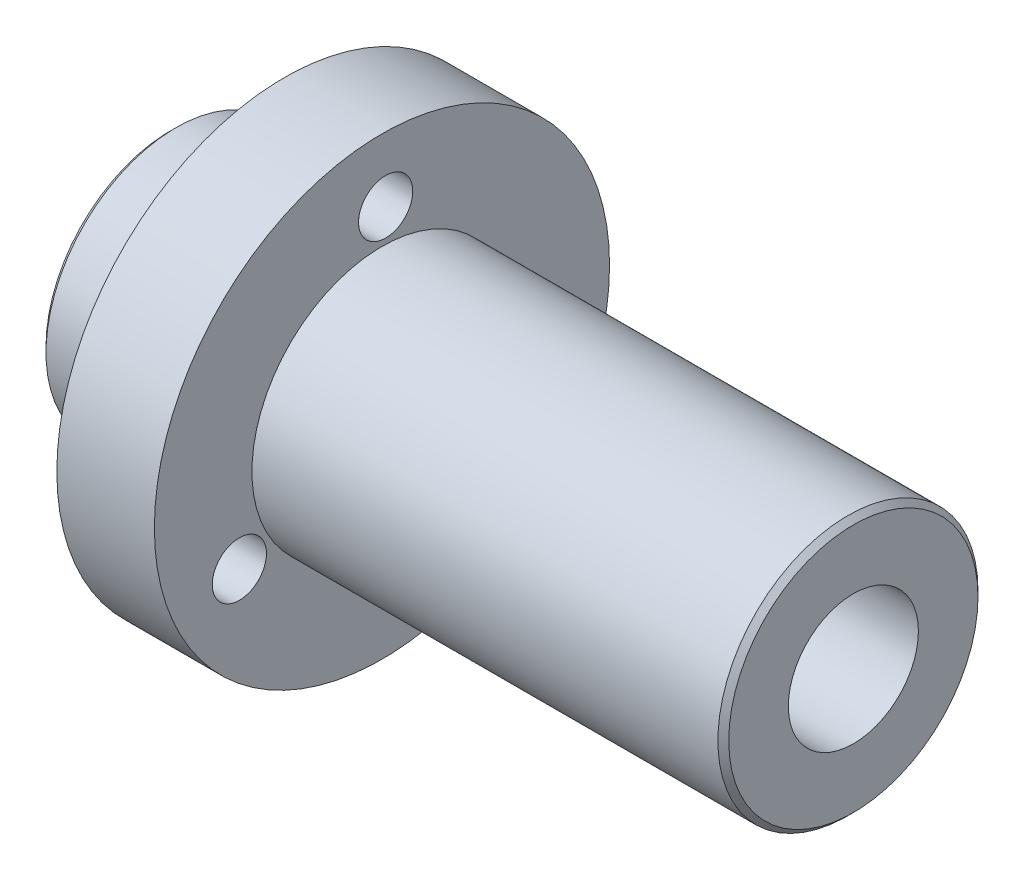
ISO-10303-21;
HEADER;
FILE_DESCRIPTION(('STEP AP214'),'2;1');
FILE_NAME('part.step','',(''),(''),'','','');
FILE_SCHEMA(('AUTOMOTIVE_DESIGN { 1 0 10303 214 1 1 1 1 }'));
ENDSEC;
DATA;
#1=APPLICATION_CONTEXT('core data for automotive mechanical design processes');
#2=APPLICATION_PROTOCOL_DEFINITION('international standard','automotive_design',2000,#1);
#3=PRODUCT_CONTEXT('',#1,'mechanical');
#4=PRODUCT('Part','Part','',(#3));
#5=PRODUCT_RELATED_PRODUCT_CATEGORY('part','',(#4));
#6=PRODUCT_DEFINITION_FORMATION('','',#4);
#7=PRODUCT_DEFINITION_CONTEXT('part definition',#1,'design');
#8=PRODUCT_DEFINITION('design','',#6,#7);
#9=PRODUCT_DEFINITION_SHAPE('','',#8);
#10=(LENGTH_UNIT() NAMED_UNIT(*) SI_UNIT(.MILLI.,.METRE.));
#11=(NAMED_UNIT(*) PLANE_ANGLE_UNIT() SI_UNIT($,.RADIAN.));
#12=(NAMED_UNIT(*) SI_UNIT($,.STERADIAN.) SOLID_ANGLE_UNIT());
#13=UNCERTAINTY_MEASURE_WITH_UNIT(LENGTH_MEASURE(1.E-05),#10,'distance_accuracy_value','');
#14=(GEOMETRIC_REPRESENTATION_CONTEXT(3) GLOBAL_UNCERTAINTY_ASSIGNED_CONTEXT((#13)) GLOBAL_UNIT_ASSIGNED_CONTEXT((#10,
#11,#12)) REPRESENTATION_CONTEXT('',''));
#15=CARTESIAN_POINT('',(0.,0.,0.));
#16=DIRECTION('',(0.,0.,1.));
#17=DIRECTION('',(1.,0.,0.));
#18=AXIS2_PLACEMENT_3D('',#15,#16,#17);
#19=CARTESIAN_POINT('',(39.,0.,0.));
#20=DIRECTION('',(1.,0.,0.));
#21=DIRECTION('',(0.,0.,-1.));
#22=AXIS2_PLACEMENT_3D('',#19,#20,#21);
#23=PLANE('',#22);
#24=CARTESIAN_POINT('',(39.,-14.4056368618,26.3149696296));
#25=DIRECTION('',(1.,0.,0.));
#26=DIRECTION('',(0.,0.,-1.));
#27=AXIS2_PLACEMENT_3D('',#24,#25,#26);
#28=CIRCLE('',#27,4.99999999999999);
#29=CARTESIAN_POINT('',(39.,-14.4056368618,21.3149696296));
#30=VERTEX_POINT('',#29);
#31=EDGE_CURVE('E76',#30,#30,#28,.T.);
#32=ORIENTED_EDGE('',*,*,#31,.F.);
#33=EDGE_LOOP('',(#32));
#34=FACE_BOUND('',#33,.T.);
#35=CARTESIAN_POINT('',(39.,29.9922506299,-0.681837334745));
#36=DIRECTION('',(1.,0.,0.));
#37=DIRECTION('',(0.,0.,-1.));
#38=AXIS2_PLACEMENT_3D('',#35,#36,#37);
#39=CIRCLE('',#38,4.99999999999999);
#40=CARTESIAN_POINT('',(39.,29.9922506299,-5.68183733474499));
#41=VERTEX_POINT('',#40);
#42=EDGE_CURVE('E70',#41,#41,#39,.T.);
#43=ORIENTED_EDGE('',*,*,#42,.F.);
#44=EDGE_LOOP('',(#43));
#45=FACE_BOUND('',#44,.T.);
#46=CARTESIAN_POINT('',(39.,-15.5866137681,-25.6331322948));
#47=DIRECTION('',(1.,0.,0.));
#48=DIRECTION('',(0.,0.,-1.));
#49=AXIS2_PLACEMENT_3D('',#46,#47,#48);
#50=CIRCLE('',#49,4.99999999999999);
#51=CARTESIAN_POINT('',(39.,-15.5866137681,-30.6331322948));
#52=VERTEX_POINT('',#51);
#53=EDGE_CURVE('E64',#52,#52,#50,.T.);
#54=ORIENTED_EDGE('',*,*,#53,.F.);
#55=EDGE_LOOP('',(#54));
#56=FACE_BOUND('',#55,.T.);
#57=CARTESIAN_POINT('',(39.,0.,0.));
#58=DIRECTION('',(1.,0.,0.));
#59=DIRECTION('',(0.,0.,-1.));
#60=AXIS2_PLACEMENT_3D('',#57,#58,#59);
#61=CIRCLE('',#60,42.);
#62=CARTESIAN_POINT('',(39.,0.,-42.));
#63=VERTEX_POINT('',#62);
#64=EDGE_CURVE('E52',#63,#63,#61,.T.);
#65=ORIENTED_EDGE('',*,*,#64,.T.);
#66=EDGE_LOOP('',(#65));
#67=FACE_BOUND('',#66,.T.);
#68=CARTESIAN_POINT('',(39.,0.,0.));
#69=DIRECTION('',(1.,0.,0.));
#70=DIRECTION('',(0.,0.,-1.));
#71=AXIS2_PLACEMENT_3D('',#68,#69,#70);
#72=CIRCLE('',#71,24.);
#73=CARTESIAN_POINT('',(39.,0.,-24.));
#74=VERTEX_POINT('',#73);
#75=EDGE_CURVE('E58',#74,#74,#72,.T.);
#76=ORIENTED_EDGE('',*,*,#75,.F.);
#77=EDGE_LOOP('',(#76));
#78=FACE_BOUND('',#77,.T.);
#79=ADVANCED_FACE('F29',(#34,#45,#56,#67,#78),#23,.T.);
#80=CARTESIAN_POINT('',(21.,42.,0.));
#81=DIRECTION('',(-1.,0.,0.));
#82=DIRECTION('',(0.,0.,1.));
#83=AXIS2_PLACEMENT_3D('',#80,#81,#82);
#84=PLANE('',#83);
#85=CARTESIAN_POINT('',(21.,-14.4056368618,26.3149696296));
#86=DIRECTION('',(-1.,0.,0.));
#87=DIRECTION('',(0.,0.,1.));
#88=AXIS2_PLACEMENT_3D('',#85,#86,#87);
#89=CIRCLE('',#88,4.99999999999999);
#90=CARTESIAN_POINT('',(21.,-14.4056368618,31.3149696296));
#91=VERTEX_POINT('',#90);
#92=EDGE_CURVE('E73',#91,#91,#89,.T.);
#93=ORIENTED_EDGE('',*,*,#92,.F.);
#94=EDGE_LOOP('',(#93));
#95=FACE_BOUND('',#94,.T.);
#96=CARTESIAN_POINT('',(21.,29.9922506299,-0.681837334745));
#97=DIRECTION('',(-1.,0.,0.));
#98=DIRECTION('',(0.,0.,1.));
#99=AXIS2_PLACEMENT_3D('',#96,#97,#98);
#100=CIRCLE('',#99,4.99999999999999);
#101=CARTESIAN_POINT('',(21.,29.9922506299,4.31816266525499));
#102=VERTEX_POINT('',#101);
#103=EDGE_CURVE('E67',#102,#102,#100,.T.);
#104=ORIENTED_EDGE('',*,*,#103,.F.);
#105=EDGE_LOOP('',(#104));
#106=FACE_BOUND('',#105,.T.);
#107=CARTESIAN_POINT('',(21.,-15.5866137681,-25.6331322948));
#108=DIRECTION('',(-1.,0.,0.));
#109=DIRECTION('',(0.,0.,1.));
#110=AXIS2_PLACEMENT_3D('',#107,#108,#109);
#111=CIRCLE('',#110,4.99999999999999);
#112=CARTESIAN_POINT('',(21.,-15.5866137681,-20.6331322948));
#113=VERTEX_POINT('',#112);
#114=EDGE_CURVE('E61',#113,#113,#111,.T.);
#115=ORIENTED_EDGE('',*,*,#114,.F.);
#116=EDGE_LOOP('',(#115));
#117=FACE_BOUND('',#116,.T.);
#118=CARTESIAN_POINT('',(21.,0.,0.));
#119=DIRECTION('',(1.,0.,0.));
#120=DIRECTION('',(0.,0.,-1.));
#121=AXIS2_PLACEMENT_3D('',#118,#119,#120);
#122=CIRCLE('',#121,42.);
#123=CARTESIAN_POINT('',(21.,0.,-42.));
#124=VERTEX_POINT('',#123);
#125=EDGE_CURVE('E49',#124,#124,#122,.T.);
#126=ORIENTED_EDGE('',*,*,#125,.F.);
#127=EDGE_LOOP('',(#126));
#128=FACE_BOUND('',#127,.T.);
#129=CARTESIAN_POINT('',(21.,0.,0.));
#130=DIRECTION('',(-1.,0.,0.));
#131=DIRECTION('',(0.,0.,1.));
#132=AXIS2_PLACEMENT_3D('',#129,#130,#131);
#133=CIRCLE('',#132,24.);
#134=CARTESIAN_POINT('',(21.,0.,-24.));
#135=VERTEX_POINT('',#134);
#136=EDGE_CURVE('E55',#135,#135,#133,.T.);
#137=ORIENTED_EDGE('',*,*,#136,.F.);
#138=EDGE_LOOP('',(#137));
#139=FACE_BOUND('',#138,.T.);
#140=ADVANCED_FACE('F108',(#95,#106,#117,#128,#139),#84,.T.);
#141=CARTESIAN_POINT('',(21.,0.,0.));
#142=DIRECTION('',(1.,0.,0.));
#143=DIRECTION('',(0.,0.,-1.));
#144=AXIS2_PLACEMENT_3D('',#141,#142,#143);
#145=CYLINDRICAL_SURFACE('',#144,42.);
#146=ORIENTED_EDGE('',*,*,#125,.T.);
#147=EDGE_LOOP('',(#146));
#148=FACE_BOUND('',#147,.T.);
#149=ORIENTED_EDGE('',*,*,#64,.F.);
#150=EDGE_LOOP('',(#149));
#151=FACE_BOUND('',#150,.T.);
#152=ADVANCED_FACE('F31',(#148,#151),#145,.T.);
#153=CARTESIAN_POINT('',(0.,0.,0.));
#154=DIRECTION('',(1.,0.,0.));
#155=DIRECTION('',(0.,0.,-1.));
#156=AXIS2_PLACEMENT_3D('',#153,#154,#155);
#157=CYLINDRICAL_SURFACE('',#156,24.);
#158=CARTESIAN_POINT('',(0.999999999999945,0.,0.));
#159=DIRECTION('',(-1.,0.,0.));
#160=DIRECTION('',(0.,0.,1.));
#161=AXIS2_PLACEMENT_3D('',#158,#159,#160);
#162=CIRCLE('',#161,24.);
#163=CARTESIAN_POINT('',(0.999999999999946,0.,-24.));
#164=VERTEX_POINT('',#163);
#165=EDGE_CURVE('E10',#164,#164,#162,.F.);
#166=CARTESIAN_POINT('',(0.999999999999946,0.,-24.));
#167=CARTESIAN_POINT('',(1.20833333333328,0.,-24.));
#168=CARTESIAN_POINT('',(1.41666666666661,0.,-24.));
#169=CARTESIAN_POINT('',(1.83333333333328,0.,-24.));
#170=CARTESIAN_POINT('',(2.04166666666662,0.,-24.));
#171=CARTESIAN_POINT('',(2.45833333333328,0.,-24.));
#172=CARTESIAN_POINT('',(2.66666666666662,0.,-24.));
#173=CARTESIAN_POINT('',(3.08333333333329,0.,-24.));
#174=CARTESIAN_POINT('',(3.29166666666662,0.,-24.));
#175=CARTESIAN_POINT('',(3.70833333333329,0.,-24.));
#176=CARTESIAN_POINT('',(3.91666666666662,0.,-24.));
#177=CARTESIAN_POINT('',(4.33333333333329,0.,-24.));
#178=CARTESIAN_POINT('',(4.54166666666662,0.,-24.));
#179=CARTESIAN_POINT('',(4.95833333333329,0.,-24.));
#180=CARTESIAN_POINT('',(5.16666666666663,0.,-24.));
#181=CARTESIAN_POINT('',(5.58333333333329,0.,-24.));
#182=CARTESIAN_POINT('',(5.79166666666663,0.,-24.));
#183=CARTESIAN_POINT('',(6.20833333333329,0.,-24.));
#184=CARTESIAN_POINT('',(6.41666666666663,0.,-24.));
#185=CARTESIAN_POINT('',(6.8333333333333,0.,-24.));
#186=CARTESIAN_POINT('',(7.04166666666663,0.,-24.));
#187=CARTESIAN_POINT('',(7.4583333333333,0.,-24.));
#188=CARTESIAN_POINT('',(7.66666666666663,0.,-24.));
#189=CARTESIAN_POINT('',(8.0833333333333,0.,-24.));
#190=CARTESIAN_POINT('',(8.29166666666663,0.,-24.));
#191=CARTESIAN_POINT('',(8.7083333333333,0.,-24.));
#192=CARTESIAN_POINT('',(8.91666666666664,0.,-24.));
#193=CARTESIAN_POINT('',(9.3333333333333,0.,-24.));
#194=CARTESIAN_POINT('',(9.54166666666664,0.,-24.));
#195=CARTESIAN_POINT('',(9.95833333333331,0.,-24.));
#196=CARTESIAN_POINT('',(10.1666666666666,0.,-24.));
#197=CARTESIAN_POINT('',(10.5833333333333,0.,-24.));
#198=CARTESIAN_POINT('',(10.7916666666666,0.,-24.));
#199=CARTESIAN_POINT('',(11.2083333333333,0.,-24.));
#200=CARTESIAN_POINT('',(11.4166666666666,0.,-24.));
#201=CARTESIAN_POINT('',(11.8333333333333,0.,-24.));
#202=CARTESIAN_POINT('',(12.0416666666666,0.,-24.));
#203=CARTESIAN_POINT('',(12.4583333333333,0.,-24.));
#204=CARTESIAN_POINT('',(12.6666666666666,0.,-24.));
#205=CARTESIAN_POINT('',(13.0833333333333,0.,-24.));
#206=CARTESIAN_POINT('',(13.2916666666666,0.,-24.));
#207=CARTESIAN_POINT('',(13.7083333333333,0.,-24.));
#208=CARTESIAN_POINT('',(13.9166666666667,0.,-24.));
#209=CARTESIAN_POINT('',(14.3333333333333,0.,-24.));
#210=CARTESIAN_POINT('',(14.5416666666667,0.,-24.));
#211=CARTESIAN_POINT('',(14.9583333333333,0.,-24.));
#212=CARTESIAN_POINT('',(15.1666666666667,0.,-24.));
#213=CARTESIAN_POINT('',(15.5833333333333,0.,-24.));
#214=CARTESIAN_POINT('',(15.7916666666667,0.,-24.));
#215=CARTESIAN_POINT('',(16.2083333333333,0.,-24.));
#216=CARTESIAN_POINT('',(16.4166666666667,0.,-24.));
#217=CARTESIAN_POINT('',(16.8333333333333,0.,-24.));
#218=CARTESIAN_POINT('',(17.0416666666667,0.,-24.));
#219=CARTESIAN_POINT('',(17.4583333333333,0.,-24.));
#220=CARTESIAN_POINT('',(17.6666666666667,0.,-24.));
#221=CARTESIAN_POINT('',(18.0833333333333,0.,-24.));
#222=CARTESIAN_POINT('',(18.2916666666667,0.,-24.));
#223=CARTESIAN_POINT('',(18.7083333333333,0.,-24.));
#224=CARTESIAN_POINT('',(18.9166666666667,0.,-24.));
#225=CARTESIAN_POINT('',(19.3333333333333,0.,-24.));
#226=CARTESIAN_POINT('',(19.5416666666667,0.,-24.));
#227=CARTESIAN_POINT('',(19.9583333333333,0.,-24.));
#228=CARTESIAN_POINT('',(20.1666666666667,0.,-24.));
#229=CARTESIAN_POINT('',(20.5833333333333,0.,-24.));
#230=CARTESIAN_POINT('',(20.7916666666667,0.,-24.));
#231=CARTESIAN_POINT('',(21.,0.,-24.));
#232=B_SPLINE_CURVE_WITH_KNOTS('',3,(#166,#167,#168,#169,#170,#171,#172,#173,#174,#175,#176,
#177,#178,#179,#180,#181,#182,#183,#184,#185,#186,#187,#188,#189,#190,#191,#192,#193,#194,#195,
#196,#197,#198,#199,#200,#201,#202,#203,#204,#205,#206,#207,#208,#209,#210,#211,#212,#213,#214,
#215,#216,#217,#218,#219,#220,#221,#222,#223,#224,#225,#226,#227,#228,#229,#230,#231),
.UNSPECIFIED.,.F.,.F.,(4,2,2,2,2,2,2,2,2,2,2,2,2,2,2,2,2,2,2,2,2,2,2,2,2,2,2,2,2,2,2,2,4),(0.,
0.625000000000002,1.25,1.87500000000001,2.50000000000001,3.12500000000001,3.75000000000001,
4.37500000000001,5.00000000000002,5.62500000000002,6.25000000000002,6.87500000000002,
7.50000000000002,8.12500000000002,8.75000000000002,9.37500000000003,10.,10.625,11.25,11.875,
12.5,13.125,13.75,14.375,15.,15.625,16.25,16.875,17.5,18.1250000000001,18.7500000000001,
19.3750000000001,20.0000000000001),.UNSPECIFIED.);
#233=EDGE_CURVE('BSEAM97',#164,#135,#232,.T.);
#234=ORIENTED_EDGE('',*,*,#165,.T.);
#235=ORIENTED_EDGE('',*,*,#136,.T.);
#236=ORIENTED_EDGE('',*,*,#233,.T.);
#237=ORIENTED_EDGE('',*,*,#233,.F.);
#238=EDGE_LOOP('',(#234,#236,#235,#237));
#239=FACE_BOUND('',#238,.T.);
#240=ADVANCED_FACE('F97',(#239),#157,.T.);
#241=CARTESIAN_POINT('',(0.,0.,0.));
#242=DIRECTION('',(-1.,0.,0.));
#243=DIRECTION('',(0.,0.,1.));
#244=AXIS2_PLACEMENT_3D('',#241,#242,#243);
#245=PLANE('',#244);
#246=CARTESIAN_POINT('',(0.,0.,0.));
#247=DIRECTION('',(-1.,0.,0.));
#248=DIRECTION('',(0.,0.,1.));
#249=AXIS2_PLACEMENT_3D('',#246,#247,#248);
#250=CIRCLE('',#249,23.0000000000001);
#251=CARTESIAN_POINT('',(0.,0.,23.0000000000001));
#252=VERTEX_POINT('',#251);
#253=EDGE_CURVE('E36',#252,#252,#250,.T.);
#254=ORIENTED_EDGE('',*,*,#253,.T.);
#255=EDGE_LOOP('',(#254));
#256=FACE_BOUND('',#255,.T.);
#257=CARTESIAN_POINT('',(0.,0.,0.));
#258=DIRECTION('',(-1.,0.,0.));
#259=DIRECTION('',(0.,0.,1.));
#260=AXIS2_PLACEMENT_3D('',#257,#258,#259);
#261=CIRCLE('',#260,18.);
#262=CARTESIAN_POINT('',(0.,0.,18.));
#263=VERTEX_POINT('',#262);
#264=EDGE_CURVE('E88',#263,#263,#261,.T.);
#265=ORIENTED_EDGE('',*,*,#264,.F.);
#266=EDGE_LOOP('',(#265));
#267=FACE_BOUND('',#266,.T.);
#268=ADVANCED_FACE('F94',(#256,#267),#245,.T.);
#269=CARTESIAN_POINT('',(126.,0.,0.));
#270=DIRECTION('',(-1.,0.,0.));
#271=DIRECTION('',(0.,0.,1.));
#272=AXIS2_PLACEMENT_3D('',#269,#270,#271);
#273=CYLINDRICAL_SURFACE('',#272,24.);
#274=CARTESIAN_POINT('',(125.,0.,0.));
#275=DIRECTION('',(1.,0.,0.));
#276=DIRECTION('',(0.,0.,-1.));
#277=AXIS2_PLACEMENT_3D('',#274,#275,#276);
#278=CIRCLE('',#277,24.);
#279=CARTESIAN_POINT('',(125.,0.,-24.));
#280=VERTEX_POINT('',#279);
#281=EDGE_CURVE('E40',#280,#280,#278,.F.);
#282=ORIENTED_EDGE('',*,*,#281,.T.);
#283=EDGE_LOOP('',(#282));
#284=FACE_BOUND('',#283,.T.);
#285=ORIENTED_EDGE('',*,*,#75,.T.);
#286=EDGE_LOOP('',(#285));
#287=FACE_BOUND('',#286,.T.);
#288=ADVANCED_FACE('F96',(#284,#287),#273,.T.);
#289=CARTESIAN_POINT('',(126.,0.,0.));
#290=DIRECTION('',(1.,0.,0.));
#291=DIRECTION('',(0.,0.,-1.));
#292=AXIS2_PLACEMENT_3D('',#289,#290,#291);
#293=PLANE('',#292);
#294=CARTESIAN_POINT('',(126.,0.,0.));
#295=DIRECTION('',(1.,0.,0.));
#296=DIRECTION('',(0.,0.,-1.));
#297=AXIS2_PLACEMENT_3D('',#294,#295,#296);
#298=CIRCLE('',#297,23.);
#299=CARTESIAN_POINT('',(126.,0.,-23.));
#300=VERTEX_POINT('',#299);
#301=EDGE_CURVE('E44',#300,#300,#298,.T.);
#302=ORIENTED_EDGE('',*,*,#301,.T.);
#303=EDGE_LOOP('',(#302));
#304=FACE_BOUND('',#303,.T.);
#305=CARTESIAN_POINT('',(126.,0.,0.));
#306=DIRECTION('',(1.,0.,0.));
#307=DIRECTION('',(0.,0.,-1.));
#308=AXIS2_PLACEMENT_3D('',#305,#306,#307);
#309=CIRCLE('',#308,12.);
#310=CARTESIAN_POINT('',(126.,0.,-12.));
#311=VERTEX_POINT('',#310);
#312=EDGE_CURVE('E79',#311,#311,#309,.T.);
#313=ORIENTED_EDGE('',*,*,#312,.F.);
#314=EDGE_LOOP('',(#313));
#315=FACE_BOUND('',#314,.T.);
#316=ADVANCED_FACE('F103',(#304,#315),#293,.T.);
#317=CARTESIAN_POINT('',(39.,-15.5866137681,-25.6331322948));
#318=DIRECTION('',(1.,0.,0.));
#319=DIRECTION('',(0.,0.,-1.));
#320=AXIS2_PLACEMENT_3D('',#317,#318,#319);
#321=CYLINDRICAL_SURFACE('',#320,4.99999999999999);
#322=ORIENTED_EDGE('',*,*,#53,.T.);
#323=EDGE_LOOP('',(#322));
#324=FACE_BOUND('',#323,.T.);
#325=ORIENTED_EDGE('',*,*,#114,.T.);
#326=EDGE_LOOP('',(#325));
#327=FACE_BOUND('',#326,.T.);
#328=ADVANCED_FACE('F168',(#324,#327),#321,.F.);
#329=CARTESIAN_POINT('',(39.,29.9922506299,-0.681837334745));
#330=DIRECTION('',(1.,0.,0.));
#331=DIRECTION('',(0.,0.,-1.));
#332=AXIS2_PLACEMENT_3D('',#329,#330,#331);
#333=CYLINDRICAL_SURFACE('',#332,4.99999999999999);
#334=ORIENTED_EDGE('',*,*,#42,.T.);
#335=EDGE_LOOP('',(#334));
#336=FACE_BOUND('',#335,.T.);
#337=ORIENTED_EDGE('',*,*,#103,.T.);
#338=EDGE_LOOP('',(#337));
#339=FACE_BOUND('',#338,.T.);
#340=ADVANCED_FACE('F210',(#336,#339),#333,.F.);
#341=CARTESIAN_POINT('',(39.,-14.4056368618,26.3149696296));
#342=DIRECTION('',(1.,0.,0.));
#343=DIRECTION('',(0.,0.,-1.));
#344=AXIS2_PLACEMENT_3D('',#341,#342,#343);
#345=CYLINDRICAL_SURFACE('',#344,4.99999999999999);
#346=ORIENTED_EDGE('',*,*,#31,.T.);
#347=EDGE_LOOP('',(#346));
#348=FACE_BOUND('',#347,.T.);
#349=ORIENTED_EDGE('',*,*,#92,.T.);
#350=EDGE_LOOP('',(#349));
#351=FACE_BOUND('',#350,.T.);
#352=ADVANCED_FACE('F206',(#348,#351),#345,.F.);
#353=CARTESIAN_POINT('',(0.,0.,0.));
#354=DIRECTION('',(-1.,0.,0.));
#355=DIRECTION('',(0.,0.,1.));
#356=AXIS2_PLACEMENT_3D('',#353,#354,#355);
#357=CYLINDRICAL_SURFACE('',#356,12.);
#358=CARTESIAN_POINT('',(99.,0.,0.));
#359=DIRECTION('',(-1.,0.,0.));
#360=DIRECTION('',(0.,0.,1.));
#361=AXIS2_PLACEMENT_3D('',#358,#359,#360);
#362=CIRCLE('',#361,12.);
#363=CARTESIAN_POINT('',(99.,0.,12.));
#364=VERTEX_POINT('',#363);
#365=EDGE_CURVE('E82',#364,#364,#362,.T.);
#366=ORIENTED_EDGE('',*,*,#365,.T.);
#367=EDGE_LOOP('',(#366));
#368=FACE_BOUND('',#367,.T.);
#369=ORIENTED_EDGE('',*,*,#312,.T.);
#370=EDGE_LOOP('',(#369));
#371=FACE_BOUND('',#370,.T.);
#372=ADVANCED_FACE('F202',(#368,#371),#357,.F.);
#373=CARTESIAN_POINT('',(99.,12.,0.));
#374=DIRECTION('',(1.,0.,0.));
#375=DIRECTION('',(0.,0.,-1.));
#376=AXIS2_PLACEMENT_3D('',#373,#374,#375);
#377=PLANE('',#376);
#378=ORIENTED_EDGE('',*,*,#365,.F.);
#379=EDGE_LOOP('',(#378));
#380=FACE_BOUND('',#379,.T.);
#381=CARTESIAN_POINT('',(99.,0.,0.));
#382=DIRECTION('',(-1.,0.,0.));
#383=DIRECTION('',(0.,0.,1.));
#384=AXIS2_PLACEMENT_3D('',#381,#382,#383);
#385=CIRCLE('',#384,18.);
#386=CARTESIAN_POINT('',(99.,0.,18.));
#387=VERTEX_POINT('',#386);
#388=EDGE_CURVE('E85',#387,#387,#385,.T.);
#389=ORIENTED_EDGE('',*,*,#388,.T.);
#390=EDGE_LOOP('',(#389));
#391=FACE_BOUND('',#390,.T.);
#392=ADVANCED_FACE('F198',(#380,#391),#377,.F.);
#393=CARTESIAN_POINT('',(0.,0.,0.));
#394=DIRECTION('',(-1.,0.,0.));
#395=DIRECTION('',(0.,0.,1.));
#396=AXIS2_PLACEMENT_3D('',#393,#394,#395);
#397=CYLINDRICAL_SURFACE('',#396,18.);
#398=ORIENTED_EDGE('',*,*,#388,.F.);
#399=EDGE_LOOP('',(#398));
#400=FACE_BOUND('',#399,.T.);
#401=ORIENTED_EDGE('',*,*,#264,.T.);
#402=EDGE_LOOP('',(#401));
#403=FACE_BOUND('',#402,.T.);
#404=ADVANCED_FACE('F92',(#400,#403),#397,.F.);
#405=CARTESIAN_POINT('',(126.,0.,0.));
#406=DIRECTION('',(-1.,0.,0.));
#407=DIRECTION('',(0.,0.,1.));
#408=AXIS2_PLACEMENT_3D('',#405,#406,#407);
#409=CONICAL_SURFACE('',#408,23.,0.785398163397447);
#410=ORIENTED_EDGE('',*,*,#281,.F.);
#411=EDGE_LOOP('',(#410));
#412=FACE_BOUND('',#411,.T.);
#413=ORIENTED_EDGE('',*,*,#301,.F.);
#414=EDGE_LOOP('',(#413));
#415=FACE_BOUND('',#414,.T.);
#416=ADVANCED_FACE('F176',(#412,#415),#409,.T.);
#417=CARTESIAN_POINT('',(0.,0.,0.));
#418=DIRECTION('',(1.,0.,0.));
#419=DIRECTION('',(0.,0.,-1.));
#420=AXIS2_PLACEMENT_3D('',#417,#418,#419);
#421=CONICAL_SURFACE('',#420,23.0000000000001,0.785398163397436);
#422=ORIENTED_EDGE('',*,*,#165,.F.);
#423=EDGE_LOOP('',(#422));
#424=FACE_BOUND('',#423,.T.);
#425=ORIENTED_EDGE('',*,*,#253,.F.);
#426=EDGE_LOOP('',(#425));
#427=FACE_BOUND('',#426,.T.);
#428=ADVANCED_FACE('F181',(#424,#427),#421,.T.);
#429=CLOSED_SHELL('',(#79,#140,#152,#240,#268,#288,#316,#328,#340,#352,#372,#392,#404,#416,#428));
#430=MANIFOLD_SOLID_BREP('B2',#429);
#431=ADVANCED_BREP_SHAPE_REPRESENTATION('',(#18,#430),#14);
#432=SHAPE_DEFINITION_REPRESENTATION(#9,#431);
ENDSEC;
END-ISO-10303-21;
